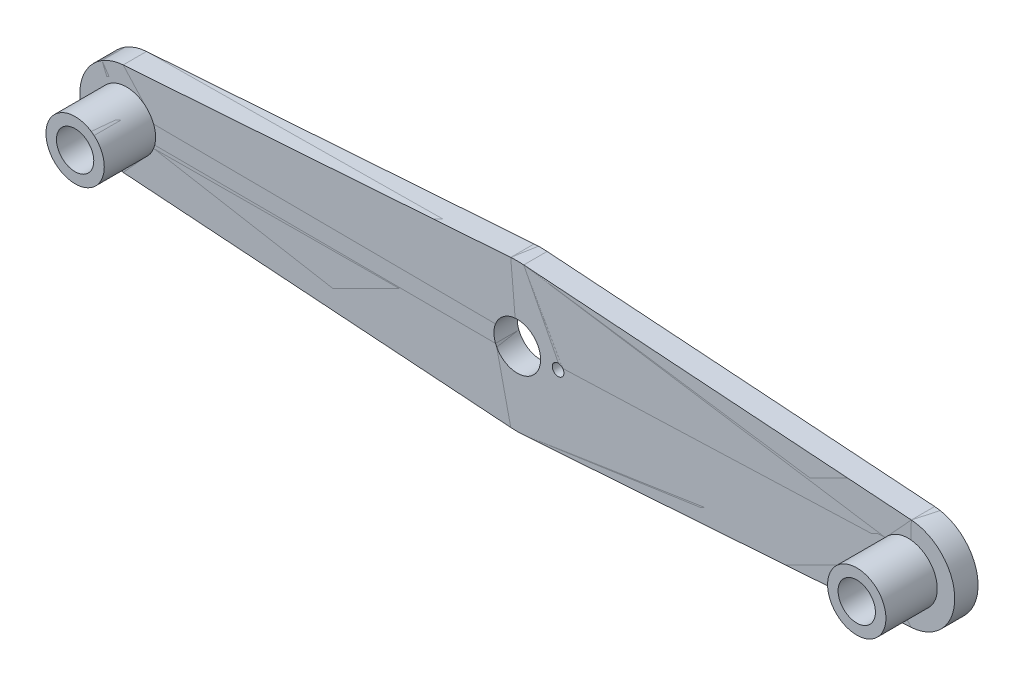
ISO-10303-21;
HEADER;
FILE_DESCRIPTION(('STEP AP214'),'2;1');
FILE_NAME('part.step','',(''),(''),'','','');
FILE_SCHEMA(('AUTOMOTIVE_DESIGN { 1 0 10303 214 1 1 1 1 }'));
ENDSEC;
DATA;
#1=APPLICATION_CONTEXT('core data for automotive mechanical design processes');
#2=APPLICATION_PROTOCOL_DEFINITION('international standard','automotive_design',2000,#1);
#3=PRODUCT_CONTEXT('',#1,'mechanical');
#4=PRODUCT('Part','Part','',(#3));
#5=PRODUCT_RELATED_PRODUCT_CATEGORY('part','',(#4));
#6=PRODUCT_DEFINITION_FORMATION('','',#4);
#7=PRODUCT_DEFINITION_CONTEXT('part definition',#1,'design');
#8=PRODUCT_DEFINITION('design','',#6,#7);
#9=PRODUCT_DEFINITION_SHAPE('','',#8);
#10=(LENGTH_UNIT() NAMED_UNIT(*) SI_UNIT(.MILLI.,.METRE.));
#11=(NAMED_UNIT(*) PLANE_ANGLE_UNIT() SI_UNIT($,.RADIAN.));
#12=(NAMED_UNIT(*) SI_UNIT($,.STERADIAN.) SOLID_ANGLE_UNIT());
#13=UNCERTAINTY_MEASURE_WITH_UNIT(LENGTH_MEASURE(1.E-05),#10,'distance_accuracy_value','');
#14=(GEOMETRIC_REPRESENTATION_CONTEXT(3) GLOBAL_UNCERTAINTY_ASSIGNED_CONTEXT((#13)) GLOBAL_UNIT_ASSIGNED_CONTEXT((#10,
#11,#12)) REPRESENTATION_CONTEXT('',''));
#15=CARTESIAN_POINT('',(0.,0.,0.));
#16=DIRECTION('',(0.,0.,1.));
#17=DIRECTION('',(1.,0.,0.));
#18=AXIS2_PLACEMENT_3D('',#15,#16,#17);
#19=CARTESIAN_POINT('',(-180.,-12.5,22.));
#20=DIRECTION('',(0.,0.,1.));
#21=DIRECTION('',(1.,0.,0.));
#22=AXIS2_PLACEMENT_3D('',#19,#20,#21);
#23=PLANE('',#22);
#24=CARTESIAN_POINT('',(-167.5,0.,22.));
#25=DIRECTION('',(0.,0.,1.));
#26=DIRECTION('',(0.,-1.,0.));
#27=AXIS2_PLACEMENT_3D('',#24,#25,#26);
#28=CIRCLE('',#27,8.00000000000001);
#29=CARTESIAN_POINT('',(-167.5,-8.00000000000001,22.));
#30=VERTEX_POINT('',#29);
#31=EDGE_CURVE('P0_E422',#30,#30,#28,.T.);
#32=ORIENTED_EDGE('',*,*,#31,.F.);
#33=EDGE_LOOP('',(#32));
#34=FACE_BOUND('',#33,.T.);
#35=CARTESIAN_POINT('',(-167.5,0.,22.));
#36=DIRECTION('',(0.,0.,1.));
#37=DIRECTION('',(1.,0.,0.));
#38=AXIS2_PLACEMENT_3D('',#35,#36,#37);
#39=CIRCLE('',#38,12.5);
#40=CARTESIAN_POINT('',(-155.,0.,22.));
#41=VERTEX_POINT('',#40);
#42=EDGE_CURVE('P0_E352',#41,#41,#39,.T.);
#43=ORIENTED_EDGE('',*,*,#42,.T.);
#44=EDGE_LOOP('',(#43));
#45=FACE_BOUND('',#44,.T.);
#46=ADVANCED_FACE('P0_F348',(#34,#45),#23,.T.);
#47=CARTESIAN_POINT('',(155.,-12.5,22.));
#48=DIRECTION('',(0.,0.,1.));
#49=DIRECTION('',(1.,0.,0.));
#50=AXIS2_PLACEMENT_3D('',#47,#48,#49);
#51=PLANE('',#50);
#52=CARTESIAN_POINT('',(167.5,0.,22.));
#53=DIRECTION('',(0.,0.,1.));
#54=DIRECTION('',(0.,-1.,0.));
#55=AXIS2_PLACEMENT_3D('',#52,#53,#54);
#56=CIRCLE('',#55,8.00000000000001);
#57=CARTESIAN_POINT('',(167.5,-8.00000000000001,22.));
#58=VERTEX_POINT('',#57);
#59=EDGE_CURVE('P0_E436',#58,#58,#56,.T.);
#60=ORIENTED_EDGE('',*,*,#59,.F.);
#61=EDGE_LOOP('',(#60));
#62=FACE_BOUND('',#61,.T.);
#63=CARTESIAN_POINT('',(167.5,0.,22.));
#64=DIRECTION('',(0.,0.,1.));
#65=DIRECTION('',(1.,0.,0.));
#66=AXIS2_PLACEMENT_3D('',#63,#64,#65);
#67=CIRCLE('',#66,12.5);
#68=CARTESIAN_POINT('',(180.,0.,22.));
#69=VERTEX_POINT('',#68);
#70=EDGE_CURVE('P0_E443',#69,#69,#67,.T.);
#71=ORIENTED_EDGE('',*,*,#70,.T.);
#72=EDGE_LOOP('',(#71));
#73=FACE_BOUND('',#72,.T.);
#74=ADVANCED_FACE('P0_F457',(#62,#73),#51,.T.);
#75=CARTESIAN_POINT('',(-167.5,0.,0.));
#76=DIRECTION('',(0.,0.,1.));
#77=DIRECTION('',(1.,0.,0.));
#78=AXIS2_PLACEMENT_3D('',#75,#76,#77);
#79=CYLINDRICAL_SURFACE('',#78,12.5);
#80=CARTESIAN_POINT('',(-167.5,0.,0.));
#81=DIRECTION('',(0.,0.,1.));
#82=DIRECTION('',(1.,0.,0.));
#83=AXIS2_PLACEMENT_3D('',#80,#81,#82);
#84=CIRCLE('',#83,12.5);
#85=CARTESIAN_POINT('',(-155.,0.,0.));
#86=VERTEX_POINT('',#85);
#87=EDGE_CURVE('P0_E515',#86,#86,#84,.F.);
#88=ORIENTED_EDGE('',*,*,#87,.F.);
#89=EDGE_LOOP('',(#88));
#90=FACE_BOUND('',#89,.T.);
#91=ORIENTED_EDGE('',*,*,#42,.F.);
#92=EDGE_LOOP('',(#91));
#93=FACE_BOUND('',#92,.T.);
#94=ADVANCED_FACE('P0_F454',(#90,#93),#79,.T.);
#95=CARTESIAN_POINT('',(167.5,0.,0.));
#96=DIRECTION('',(0.,0.,1.));
#97=DIRECTION('',(1.,0.,0.));
#98=AXIS2_PLACEMENT_3D('',#95,#96,#97);
#99=CYLINDRICAL_SURFACE('',#98,12.5);
#100=CARTESIAN_POINT('',(167.5,0.,0.));
#101=DIRECTION('',(0.,0.,1.));
#102=DIRECTION('',(1.,0.,0.));
#103=AXIS2_PLACEMENT_3D('',#100,#101,#102);
#104=CIRCLE('',#103,12.5);
#105=CARTESIAN_POINT('',(180.,0.,0.));
#106=VERTEX_POINT('',#105);
#107=EDGE_CURVE('P0_E512',#106,#106,#104,.F.);
#108=ORIENTED_EDGE('',*,*,#107,.F.);
#109=EDGE_LOOP('',(#108));
#110=FACE_BOUND('',#109,.T.);
#111=ORIENTED_EDGE('',*,*,#70,.F.);
#112=EDGE_LOOP('',(#111));
#113=FACE_BOUND('',#112,.T.);
#114=ADVANCED_FACE('P0_F456',(#110,#113),#99,.T.);
#115=CARTESIAN_POINT('',(-167.5,0.,-10.));
#116=DIRECTION('',(0.,0.,1.));
#117=DIRECTION('',(0.,-1.,0.));
#118=AXIS2_PLACEMENT_3D('',#115,#116,#117);
#119=CYLINDRICAL_SURFACE('',#118,20.);
#120=DIRECTION('',(0.,0.,1.));
#121=VECTOR('',#120,1.);
#122=CARTESIAN_POINT('',(-168.89512947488,19.951281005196,-83.255240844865));
#123=LINE('',#122,#121);
#124=CARTESIAN_POINT('',(-168.895129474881,19.9512810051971,-10.));
#125=VERTEX_POINT('',#124);
#126=CARTESIAN_POINT('',(-168.895129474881,19.9512810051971,0.));
#127=VERTEX_POINT('',#126);
#128=EDGE_CURVE('P0_E445',#125,#127,#123,.T.);
#129=ORIENTED_EDGE('',*,*,#128,.F.);
#130=CARTESIAN_POINT('',(-167.5,0.,-10.));
#131=DIRECTION('',(0.,0.,1.));
#132=DIRECTION('',(0.,-1.,0.));
#133=AXIS2_PLACEMENT_3D('',#130,#131,#132);
#134=CIRCLE('',#133,20.);
#135=CARTESIAN_POINT('',(-168.895129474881,-19.9512810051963,-10.));
#136=VERTEX_POINT('',#135);
#137=EDGE_CURVE('P0_E551',#136,#125,#134,.F.);
#138=ORIENTED_EDGE('',*,*,#137,.F.);
#139=DIRECTION('',(0.,0.,-1.));
#140=VECTOR('',#139,1.);
#141=CARTESIAN_POINT('',(-168.89512947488,-19.951281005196,-83.255240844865));
#142=LINE('',#141,#140);
#143=CARTESIAN_POINT('',(-168.895129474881,-19.9512810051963,0.));
#144=VERTEX_POINT('',#143);
#145=EDGE_CURVE('P0_E412',#144,#136,#142,.T.);
#146=ORIENTED_EDGE('',*,*,#145,.F.);
#147=CARTESIAN_POINT('',(-167.5,0.,0.));
#148=DIRECTION('',(0.,0.,1.));
#149=DIRECTION('',(0.,-1.,0.));
#150=AXIS2_PLACEMENT_3D('',#147,#148,#149);
#151=CIRCLE('',#150,20.);
#152=EDGE_CURVE('P0_E435',#127,#144,#151,.T.);
#153=ORIENTED_EDGE('',*,*,#152,.F.);
#154=EDGE_LOOP('',(#129,#138,#146,#153));
#155=FACE_BOUND('',#154,.T.);
#156=ADVANCED_FACE('P0_F464',(#155),#119,.T.);
#157=CARTESIAN_POINT('',(-2.7902589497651,31.566465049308,0.));
#158=DIRECTION('',(-0.0697564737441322,0.997564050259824,0.));
#159=DIRECTION('',(0.,0.,-1.));
#160=AXIS2_PLACEMENT_3D('',#157,#158,#159);
#161=PLANE('',#160);
#162=DIRECTION('',(0.997564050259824,0.0697564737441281,0.));
#163=VECTOR('',#162,1.);
#164=CARTESIAN_POINT('',(-168.895129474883,19.9512810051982,-10.));
#165=LINE('',#164,#163);
#166=CARTESIAN_POINT('',(-2.79025894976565,31.5664650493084,-10.));
#167=VERTEX_POINT('',#166);
#168=EDGE_CURVE('P0_E548',#125,#167,#165,.T.);
#169=ORIENTED_EDGE('',*,*,#168,.F.);
#170=ORIENTED_EDGE('',*,*,#128,.T.);
#171=DIRECTION('',(-0.997564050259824,-0.0697564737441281,0.));
#172=VECTOR('',#171,1.);
#173=CARTESIAN_POINT('',(-2.79025894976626,31.5664650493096,0.));
#174=LINE('',#173,#172);
#175=CARTESIAN_POINT('',(-2.79025894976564,31.5664650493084,0.));
#176=VERTEX_POINT('',#175);
#177=EDGE_CURVE('P0_E558',#176,#127,#174,.T.);
#178=ORIENTED_EDGE('',*,*,#177,.F.);
#179=DIRECTION('',(0.,0.,-1.));
#180=VECTOR('',#179,1.);
#181=CARTESIAN_POINT('',(-2.79025894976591,31.5664650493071,-5.));
#182=LINE('',#181,#180);
#183=EDGE_CURVE('P0_E448',#176,#167,#182,.T.);
#184=ORIENTED_EDGE('',*,*,#183,.T.);
#185=EDGE_LOOP('',(#169,#170,#178,#184));
#186=FACE_BOUND('',#185,.T.);
#187=ADVANCED_FACE('P0_F486',(#186),#161,.T.);
#188=CARTESIAN_POINT('',(-1.1487285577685E-13,-8.3360969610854,0.));
#189=DIRECTION('',(0.,0.,-1.));
#190=DIRECTION('',(-1.,0.,0.));
#191=AXIS2_PLACEMENT_3D('',#188,#189,#190);
#192=CYLINDRICAL_SURFACE('',#191,39.9999999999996);
#193=CARTESIAN_POINT('',(-1.1487285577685E-13,-8.3360969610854,0.));
#194=DIRECTION('',(0.,0.,-1.));
#195=DIRECTION('',(-1.,0.,0.));
#196=AXIS2_PLACEMENT_3D('',#193,#194,#195);
#197=CIRCLE('',#196,39.9999999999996);
#198=CARTESIAN_POINT('',(2.79025894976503,31.5664650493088,0.));
#199=VERTEX_POINT('',#198);
#200=EDGE_CURVE('P0_E560',#199,#176,#197,.F.);
#201=ORIENTED_EDGE('',*,*,#200,.F.);
#202=DIRECTION('',(0.,0.,1.));
#203=VECTOR('',#202,1.);
#204=CARTESIAN_POINT('',(2.7902589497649,31.566465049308,-83.255240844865));
#205=LINE('',#204,#203);
#206=CARTESIAN_POINT('',(2.79025894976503,31.5664650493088,-10.));
#207=VERTEX_POINT('',#206);
#208=EDGE_CURVE('P0_E577',#207,#199,#205,.T.);
#209=ORIENTED_EDGE('',*,*,#208,.F.);
#210=CARTESIAN_POINT('',(-1.1487285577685E-13,-8.3360969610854,-10.));
#211=DIRECTION('',(0.,0.,-1.));
#212=DIRECTION('',(-1.,0.,0.));
#213=AXIS2_PLACEMENT_3D('',#210,#211,#212);
#214=CIRCLE('',#213,39.9999999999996);
#215=EDGE_CURVE('P0_E545',#167,#207,#214,.T.);
#216=ORIENTED_EDGE('',*,*,#215,.F.);
#217=ORIENTED_EDGE('',*,*,#183,.F.);
#218=EDGE_LOOP('',(#201,#209,#216,#217));
#219=FACE_BOUND('',#218,.T.);
#220=ADVANCED_FACE('P0_F489',(#219),#192,.T.);
#221=CARTESIAN_POINT('',(168.89512947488,19.951281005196,0.));
#222=DIRECTION('',(0.0697564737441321,0.997564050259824,0.));
#223=DIRECTION('',(0.,0.,-1.));
#224=AXIS2_PLACEMENT_3D('',#221,#222,#223);
#225=PLANE('',#224);
#226=DIRECTION('',(0.997564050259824,-0.0697564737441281,0.));
#227=VECTOR('',#226,1.);
#228=CARTESIAN_POINT('',(2.79025894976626,31.5664650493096,-10.));
#229=LINE('',#228,#227);
#230=CARTESIAN_POINT('',(168.895129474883,19.9512810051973,-10.));
#231=VERTEX_POINT('',#230);
#232=EDGE_CURVE('P0_E542',#207,#231,#229,.T.);
#233=ORIENTED_EDGE('',*,*,#232,.F.);
#234=ORIENTED_EDGE('',*,*,#208,.T.);
#235=DIRECTION('',(-0.997564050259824,0.0697564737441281,0.));
#236=VECTOR('',#235,1.);
#237=CARTESIAN_POINT('',(168.895129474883,19.9512810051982,0.));
#238=LINE('',#237,#236);
#239=CARTESIAN_POINT('',(168.895129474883,19.9512810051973,0.));
#240=VERTEX_POINT('',#239);
#241=EDGE_CURVE('P0_E563',#240,#199,#238,.T.);
#242=ORIENTED_EDGE('',*,*,#241,.F.);
#243=DIRECTION('',(0.,0.,-1.));
#244=VECTOR('',#243,1.);
#245=CARTESIAN_POINT('',(168.895129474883,19.9512810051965,-5.));
#246=LINE('',#245,#244);
#247=EDGE_CURVE('P0_E573',#240,#231,#246,.T.);
#248=ORIENTED_EDGE('',*,*,#247,.T.);
#249=EDGE_LOOP('',(#233,#234,#242,#248));
#250=FACE_BOUND('',#249,.T.);
#251=ADVANCED_FACE('P0_F491',(#250),#225,.T.);
#252=CARTESIAN_POINT('',(167.5,0.,-10.));
#253=DIRECTION('',(0.,0.,1.));
#254=DIRECTION('',(0.,-1.,0.));
#255=AXIS2_PLACEMENT_3D('',#252,#253,#254);
#256=CYLINDRICAL_SURFACE('',#255,20.);
#257=DIRECTION('',(0.,0.,1.));
#258=VECTOR('',#257,1.);
#259=CARTESIAN_POINT('',(168.89512947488,-19.951281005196,-83.255240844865));
#260=LINE('',#259,#258);
#261=CARTESIAN_POINT('',(168.895129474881,-19.9512810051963,-10.));
#262=VERTEX_POINT('',#261);
#263=CARTESIAN_POINT('',(168.895129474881,-19.9512810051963,0.));
#264=VERTEX_POINT('',#263);
#265=EDGE_CURVE('P0_E570',#262,#264,#260,.T.);
#266=ORIENTED_EDGE('',*,*,#265,.F.);
#267=CARTESIAN_POINT('',(167.5,0.,-10.));
#268=DIRECTION('',(0.,0.,1.));
#269=DIRECTION('',(0.,-1.,0.));
#270=AXIS2_PLACEMENT_3D('',#267,#268,#269);
#271=CIRCLE('',#270,20.);
#272=EDGE_CURVE('P0_E539',#231,#262,#271,.F.);
#273=ORIENTED_EDGE('',*,*,#272,.F.);
#274=ORIENTED_EDGE('',*,*,#247,.F.);
#275=CARTESIAN_POINT('',(167.5,0.,0.));
#276=DIRECTION('',(0.,0.,1.));
#277=DIRECTION('',(0.,-1.,0.));
#278=AXIS2_PLACEMENT_3D('',#275,#276,#277);
#279=CIRCLE('',#278,20.);
#280=EDGE_CURVE('P0_E566',#264,#240,#279,.T.);
#281=ORIENTED_EDGE('',*,*,#280,.F.);
#282=EDGE_LOOP('',(#266,#273,#274,#281));
#283=FACE_BOUND('',#282,.T.);
#284=ADVANCED_FACE('P0_F494',(#283),#256,.T.);
#285=CARTESIAN_POINT('',(2.790258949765,-31.566465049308,0.));
#286=DIRECTION('',(0.0697564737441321,-0.997564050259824,0.));
#287=DIRECTION('',(0.,0.,-1.));
#288=AXIS2_PLACEMENT_3D('',#285,#286,#287);
#289=PLANE('',#288);
#290=DIRECTION('',(-0.997564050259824,-0.0697564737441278,0.));
#291=VECTOR('',#290,1.);
#292=CARTESIAN_POINT('',(168.895129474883,-19.9512810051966,-10.));
#293=LINE('',#292,#291);
#294=CARTESIAN_POINT('',(2.79025894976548,-31.5664650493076,-10.));
#295=VERTEX_POINT('',#294);
#296=EDGE_CURVE('P0_E536',#262,#295,#293,.T.);
#297=ORIENTED_EDGE('',*,*,#296,.F.);
#298=ORIENTED_EDGE('',*,*,#265,.T.);
#299=DIRECTION('',(0.997564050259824,0.0697564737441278,0.));
#300=VECTOR('',#299,1.);
#301=CARTESIAN_POINT('',(2.79025894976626,-31.566465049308,0.));
#302=LINE('',#301,#300);
#303=CARTESIAN_POINT('',(2.79025894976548,-31.5664650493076,0.));
#304=VERTEX_POINT('',#303);
#305=EDGE_CURVE('P0_E431',#304,#264,#302,.T.);
#306=ORIENTED_EDGE('',*,*,#305,.F.);
#307=DIRECTION('',(0.,0.,-1.));
#308=VECTOR('',#307,1.);
#309=CARTESIAN_POINT('',(2.79025894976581,-31.5664650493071,-5.));
#310=LINE('',#309,#308);
#311=EDGE_CURVE('P0_E427',#304,#295,#310,.T.);
#312=ORIENTED_EDGE('',*,*,#311,.T.);
#313=EDGE_LOOP('',(#297,#298,#306,#312));
#314=FACE_BOUND('',#313,.T.);
#315=ADVANCED_FACE('P0_F496',(#314),#289,.T.);
#316=CARTESIAN_POINT('',(0.,8.3360969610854,0.));
#317=DIRECTION('',(0.,0.,-1.));
#318=DIRECTION('',(-1.,0.,0.));
#319=AXIS2_PLACEMENT_3D('',#316,#317,#318);
#320=CYLINDRICAL_SURFACE('',#319,39.9999999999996);
#321=CARTESIAN_POINT('',(0.,8.3360969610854,0.));
#322=DIRECTION('',(0.,0.,-1.));
#323=DIRECTION('',(-1.,0.,0.));
#324=AXIS2_PLACEMENT_3D('',#321,#322,#323);
#325=CIRCLE('',#324,39.9999999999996);
#326=CARTESIAN_POINT('',(-2.79025894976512,-31.566465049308,0.));
#327=VERTEX_POINT('',#326);
#328=EDGE_CURVE('P0_E425',#327,#304,#325,.F.);
#329=ORIENTED_EDGE('',*,*,#328,.F.);
#330=DIRECTION('',(0.,0.,1.));
#331=VECTOR('',#330,1.);
#332=CARTESIAN_POINT('',(-2.7902589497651,-31.566465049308,-83.255240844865));
#333=LINE('',#332,#331);
#334=CARTESIAN_POINT('',(-2.79025894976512,-31.566465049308,-10.));
#335=VERTEX_POINT('',#334);
#336=EDGE_CURVE('P0_E367',#335,#327,#333,.T.);
#337=ORIENTED_EDGE('',*,*,#336,.F.);
#338=CARTESIAN_POINT('',(0.,8.3360969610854,-10.));
#339=DIRECTION('',(0.,0.,-1.));
#340=DIRECTION('',(-1.,0.,0.));
#341=AXIS2_PLACEMENT_3D('',#338,#339,#340);
#342=CIRCLE('',#341,39.9999999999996);
#343=EDGE_CURVE('P0_E534',#295,#335,#342,.T.);
#344=ORIENTED_EDGE('',*,*,#343,.F.);
#345=ORIENTED_EDGE('',*,*,#311,.F.);
#346=EDGE_LOOP('',(#329,#337,#344,#345));
#347=FACE_BOUND('',#346,.T.);
#348=ADVANCED_FACE('P0_F426',(#347),#320,.T.);
#349=CARTESIAN_POINT('',(-168.89512947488,-19.951281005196,0.));
#350=DIRECTION('',(-0.0697564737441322,-0.997564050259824,0.));
#351=DIRECTION('',(0.,0.,-1.));
#352=AXIS2_PLACEMENT_3D('',#349,#350,#351);
#353=PLANE('',#352);
#354=DIRECTION('',(-0.997564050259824,0.0697564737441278,0.));
#355=VECTOR('',#354,1.);
#356=CARTESIAN_POINT('',(-2.79025894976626,-31.566465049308,-10.));
#357=LINE('',#356,#355);
#358=EDGE_CURVE('P0_E420',#335,#136,#357,.T.);
#359=ORIENTED_EDGE('',*,*,#358,.F.);
#360=ORIENTED_EDGE('',*,*,#336,.T.);
#361=DIRECTION('',(0.997564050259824,-0.0697564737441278,0.));
#362=VECTOR('',#361,1.);
#363=CARTESIAN_POINT('',(-168.895129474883,-19.9512810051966,0.));
#364=LINE('',#363,#362);
#365=EDGE_CURVE('P0_E417',#144,#327,#364,.T.);
#366=ORIENTED_EDGE('',*,*,#365,.F.);
#367=ORIENTED_EDGE('',*,*,#145,.T.);
#368=EDGE_LOOP('',(#359,#360,#366,#367));
#369=FACE_BOUND('',#368,.T.);
#370=ADVANCED_FACE('P0_F415',(#369),#353,.T.);
#371=CARTESIAN_POINT('',(17.5,0.,-10.));
#372=DIRECTION('',(0.,0.,1.));
#373=DIRECTION('',(0.,-1.,0.));
#374=AXIS2_PLACEMENT_3D('',#371,#372,#373);
#375=CYLINDRICAL_SURFACE('',#374,2.5);
#376=CARTESIAN_POINT('',(17.5,0.,-10.));
#377=DIRECTION('',(0.,0.,1.));
#378=DIRECTION('',(0.,-1.,0.));
#379=AXIS2_PLACEMENT_3D('',#376,#377,#378);
#380=CIRCLE('',#379,2.5);
#381=CARTESIAN_POINT('',(17.5,-2.5,-10.));
#382=VERTEX_POINT('',#381);
#383=EDGE_CURVE('P0_E530',#382,#382,#380,.T.);
#384=ORIENTED_EDGE('',*,*,#383,.F.);
#385=EDGE_LOOP('',(#384));
#386=FACE_BOUND('',#385,.T.);
#387=CARTESIAN_POINT('',(17.5,0.,0.));
#388=DIRECTION('',(0.,0.,1.));
#389=DIRECTION('',(0.,-1.,0.));
#390=AXIS2_PLACEMENT_3D('',#387,#388,#389);
#391=CIRCLE('',#390,2.5);
#392=CARTESIAN_POINT('',(17.5,-2.5,0.));
#393=VERTEX_POINT('',#392);
#394=EDGE_CURVE('P0_E519',#393,#393,#391,.F.);
#395=ORIENTED_EDGE('',*,*,#394,.F.);
#396=EDGE_LOOP('',(#395));
#397=FACE_BOUND('',#396,.T.);
#398=ADVANCED_FACE('P0_F501',(#386,#397),#375,.F.);
#399=CARTESIAN_POINT('',(-167.5,0.,-10.));
#400=DIRECTION('',(0.,0.,1.));
#401=DIRECTION('',(0.,-1.,0.));
#402=AXIS2_PLACEMENT_3D('',#399,#400,#401);
#403=CYLINDRICAL_SURFACE('',#402,8.00000000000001);
#404=CARTESIAN_POINT('',(-167.5,0.,-10.));
#405=DIRECTION('',(0.,0.,1.));
#406=DIRECTION('',(0.,-1.,0.));
#407=AXIS2_PLACEMENT_3D('',#404,#405,#406);
#408=CIRCLE('',#407,8.00000000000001);
#409=CARTESIAN_POINT('',(-167.5,-8.00000000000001,-10.));
#410=VERTEX_POINT('',#409);
#411=EDGE_CURVE('P0_E525',#410,#410,#408,.T.);
#412=ORIENTED_EDGE('',*,*,#411,.F.);
#413=EDGE_LOOP('',(#412));
#414=FACE_BOUND('',#413,.T.);
#415=ORIENTED_EDGE('',*,*,#31,.T.);
#416=EDGE_LOOP('',(#415));
#417=FACE_BOUND('',#416,.T.);
#418=ADVANCED_FACE('P0_F507',(#414,#417),#403,.F.);
#419=CARTESIAN_POINT('',(167.5,0.,-10.));
#420=DIRECTION('',(0.,0.,1.));
#421=DIRECTION('',(0.,-1.,0.));
#422=AXIS2_PLACEMENT_3D('',#419,#420,#421);
#423=CYLINDRICAL_SURFACE('',#422,8.00000000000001);
#424=CARTESIAN_POINT('',(167.5,0.,-10.));
#425=DIRECTION('',(0.,0.,1.));
#426=DIRECTION('',(0.,-1.,0.));
#427=AXIS2_PLACEMENT_3D('',#424,#425,#426);
#428=CIRCLE('',#427,8.00000000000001);
#429=CARTESIAN_POINT('',(167.5,-8.00000000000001,-10.));
#430=VERTEX_POINT('',#429);
#431=EDGE_CURVE('P0_E522',#430,#430,#428,.T.);
#432=ORIENTED_EDGE('',*,*,#431,.F.);
#433=EDGE_LOOP('',(#432));
#434=FACE_BOUND('',#433,.T.);
#435=ORIENTED_EDGE('',*,*,#59,.T.);
#436=EDGE_LOOP('',(#435));
#437=FACE_BOUND('',#436,.T.);
#438=ADVANCED_FACE('P0_F481',(#434,#437),#423,.F.);
#439=CARTESIAN_POINT('',(-187.5,-35.413903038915,0.));
#440=DIRECTION('',(0.,0.,1.));
#441=DIRECTION('',(1.,0.,0.));
#442=AXIS2_PLACEMENT_3D('',#439,#440,#441);
#443=PLANE('',#442);
#444=ORIENTED_EDGE('',*,*,#107,.T.);
#445=EDGE_LOOP('',(#444));
#446=FACE_BOUND('',#445,.T.);
#447=ORIENTED_EDGE('',*,*,#87,.T.);
#448=EDGE_LOOP('',(#447));
#449=FACE_BOUND('',#448,.T.);
#450=ORIENTED_EDGE('',*,*,#394,.T.);
#451=EDGE_LOOP('',(#450));
#452=FACE_BOUND('',#451,.T.);
#453=CARTESIAN_POINT('',(0.,0.,0.));
#454=DIRECTION('',(0.,0.,-1.));
#455=DIRECTION('',(-1.,0.,0.));
#456=AXIS2_PLACEMENT_3D('',#453,#454,#455);
#457=CIRCLE('',#456,10.);
#458=CARTESIAN_POINT('',(-10.,0.,0.));
#459=VERTEX_POINT('',#458);
#460=EDGE_CURVE('P0_E358',#459,#459,#457,.F.);
#461=ORIENTED_EDGE('',*,*,#460,.F.);
#462=EDGE_LOOP('',(#461));
#463=FACE_BOUND('',#462,.T.);
#464=ORIENTED_EDGE('',*,*,#177,.T.);
#465=ORIENTED_EDGE('',*,*,#152,.T.);
#466=ORIENTED_EDGE('',*,*,#365,.T.);
#467=ORIENTED_EDGE('',*,*,#328,.T.);
#468=ORIENTED_EDGE('',*,*,#305,.T.);
#469=ORIENTED_EDGE('',*,*,#280,.T.);
#470=ORIENTED_EDGE('',*,*,#241,.T.);
#471=ORIENTED_EDGE('',*,*,#200,.T.);
#472=EDGE_LOOP('',(#464,#465,#466,#467,#468,#469,#470,#471));
#473=FACE_BOUND('',#472,.T.);
#474=ADVANCED_FACE('P0_F434',(#446,#449,#452,#463,#473),#443,.T.);
#475=CARTESIAN_POINT('',(187.5,-35.413903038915,-10.));
#476=DIRECTION('',(0.,0.,-1.));
#477=DIRECTION('',(-1.,0.,0.));
#478=AXIS2_PLACEMENT_3D('',#475,#476,#477);
#479=PLANE('',#478);
#480=ORIENTED_EDGE('',*,*,#431,.T.);
#481=EDGE_LOOP('',(#480));
#482=FACE_BOUND('',#481,.T.);
#483=ORIENTED_EDGE('',*,*,#411,.T.);
#484=EDGE_LOOP('',(#483));
#485=FACE_BOUND('',#484,.T.);
#486=ORIENTED_EDGE('',*,*,#383,.T.);
#487=EDGE_LOOP('',(#486));
#488=FACE_BOUND('',#487,.T.);
#489=CARTESIAN_POINT('',(0.,0.,-10.));
#490=DIRECTION('',(0.,0.,-1.));
#491=DIRECTION('',(-1.,0.,0.));
#492=AXIS2_PLACEMENT_3D('',#489,#490,#491);
#493=CIRCLE('',#492,10.);
#494=CARTESIAN_POINT('',(-10.,0.,-10.));
#495=VERTEX_POINT('',#494);
#496=EDGE_CURVE('P0_E11',#495,#495,#493,.T.);
#497=ORIENTED_EDGE('',*,*,#496,.F.);
#498=EDGE_LOOP('',(#497));
#499=FACE_BOUND('',#498,.T.);
#500=ORIENTED_EDGE('',*,*,#343,.T.);
#501=ORIENTED_EDGE('',*,*,#358,.T.);
#502=ORIENTED_EDGE('',*,*,#137,.T.);
#503=ORIENTED_EDGE('',*,*,#168,.T.);
#504=ORIENTED_EDGE('',*,*,#215,.T.);
#505=ORIENTED_EDGE('',*,*,#232,.T.);
#506=ORIENTED_EDGE('',*,*,#272,.T.);
#507=ORIENTED_EDGE('',*,*,#296,.T.);
#508=EDGE_LOOP('',(#500,#501,#502,#503,#504,#505,#506,#507));
#509=FACE_BOUND('',#508,.T.);
#510=ADVANCED_FACE('P0_F350',(#482,#485,#488,#499,#509),#479,.T.);
#511=CARTESIAN_POINT('',(0.,0.,0.));
#512=DIRECTION('',(0.,0.,-1.));
#513=DIRECTION('',(-1.,0.,0.));
#514=AXIS2_PLACEMENT_3D('',#511,#512,#513);
#515=CYLINDRICAL_SURFACE('',#514,10.);
#516=ORIENTED_EDGE('',*,*,#496,.T.);
#517=EDGE_LOOP('',(#516));
#518=FACE_BOUND('',#517,.T.);
#519=ORIENTED_EDGE('',*,*,#460,.T.);
#520=EDGE_LOOP('',(#519));
#521=FACE_BOUND('',#520,.T.);
#522=ADVANCED_FACE('P0_F470',(#518,#521),#515,.F.);
#523=CLOSED_SHELL('',(#46,#74,#94,#114,#156,#187,#220,#251,#284,#315,#348,#370,#398,#418,#438,
#474,#510,#522));
#524=MANIFOLD_SOLID_BREP('P0_B2',#523);
#525=CARTESIAN_POINT('',(-180.,-12.5,22.));
#526=DIRECTION('',(0.,0.,1.));
#527=DIRECTION('',(1.,0.,0.));
#528=AXIS2_PLACEMENT_3D('',#525,#526,#527);
#529=PLANE('',#528);
#530=CARTESIAN_POINT('',(-167.5,0.,22.));
#531=DIRECTION('',(0.,0.,1.));
#532=DIRECTION('',(0.,-1.,0.));
#533=AXIS2_PLACEMENT_3D('',#530,#531,#532);
#534=CIRCLE('',#533,8.00000000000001);
#535=CARTESIAN_POINT('',(-167.5,-8.00000000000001,22.));
#536=VERTEX_POINT('',#535);
#537=EDGE_CURVE('P1_E89',#536,#536,#534,.T.);
#538=ORIENTED_EDGE('',*,*,#537,.F.);
#539=EDGE_LOOP('',(#538));
#540=FACE_BOUND('',#539,.T.);
#541=CARTESIAN_POINT('',(-167.5,0.,22.));
#542=DIRECTION('',(0.,0.,1.));
#543=DIRECTION('',(1.,0.,0.));
#544=AXIS2_PLACEMENT_3D('',#541,#542,#543);
#545=CIRCLE('',#544,12.5);
#546=CARTESIAN_POINT('',(-155.,0.,22.));
#547=VERTEX_POINT('',#546);
#548=EDGE_CURVE('P1_E19',#547,#547,#545,.T.);
#549=ORIENTED_EDGE('',*,*,#548,.T.);
#550=EDGE_LOOP('',(#549));
#551=FACE_BOUND('',#550,.T.);
#552=ADVANCED_FACE('P1_F15',(#540,#551),#529,.T.);
#553=CARTESIAN_POINT('',(155.,-12.5,22.));
#554=DIRECTION('',(0.,0.,1.));
#555=DIRECTION('',(1.,0.,0.));
#556=AXIS2_PLACEMENT_3D('',#553,#554,#555);
#557=PLANE('',#556);
#558=CARTESIAN_POINT('',(167.5,0.,22.));
#559=DIRECTION('',(0.,0.,1.));
#560=DIRECTION('',(0.,-1.,0.));
#561=AXIS2_PLACEMENT_3D('',#558,#559,#560);
#562=CIRCLE('',#561,8.00000000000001);
#563=CARTESIAN_POINT('',(167.5,-8.00000000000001,22.));
#564=VERTEX_POINT('',#563);
#565=EDGE_CURVE('P1_E103',#564,#564,#562,.T.);
#566=ORIENTED_EDGE('',*,*,#565,.F.);
#567=EDGE_LOOP('',(#566));
#568=FACE_BOUND('',#567,.T.);
#569=CARTESIAN_POINT('',(167.5,0.,22.));
#570=DIRECTION('',(0.,0.,1.));
#571=DIRECTION('',(1.,0.,0.));
#572=AXIS2_PLACEMENT_3D('',#569,#570,#571);
#573=CIRCLE('',#572,12.5);
#574=CARTESIAN_POINT('',(180.,0.,22.));
#575=VERTEX_POINT('',#574);
#576=EDGE_CURVE('P1_E110',#575,#575,#573,.T.);
#577=ORIENTED_EDGE('',*,*,#576,.T.);
#578=EDGE_LOOP('',(#577));
#579=FACE_BOUND('',#578,.T.);
#580=ADVANCED_FACE('P1_F124',(#568,#579),#557,.T.);
#581=CARTESIAN_POINT('',(-167.5,0.,0.));
#582=DIRECTION('',(0.,0.,1.));
#583=DIRECTION('',(1.,0.,0.));
#584=AXIS2_PLACEMENT_3D('',#581,#582,#583);
#585=CYLINDRICAL_SURFACE('',#584,12.5);
#586=CARTESIAN_POINT('',(-167.5,0.,0.));
#587=DIRECTION('',(0.,0.,1.));
#588=DIRECTION('',(1.,0.,0.));
#589=AXIS2_PLACEMENT_3D('',#586,#587,#588);
#590=CIRCLE('',#589,12.5);
#591=CARTESIAN_POINT('',(-155.,0.,0.));
#592=VERTEX_POINT('',#591);
#593=EDGE_CURVE('P1_E180',#592,#592,#590,.F.);
#594=ORIENTED_EDGE('',*,*,#593,.F.);
#595=EDGE_LOOP('',(#594));
#596=FACE_BOUND('',#595,.T.);
#597=ORIENTED_EDGE('',*,*,#548,.F.);
#598=EDGE_LOOP('',(#597));
#599=FACE_BOUND('',#598,.T.);
#600=ADVANCED_FACE('P1_F121',(#596,#599),#585,.T.);
#601=CARTESIAN_POINT('',(167.5,0.,0.));
#602=DIRECTION('',(0.,0.,1.));
#603=DIRECTION('',(1.,0.,0.));
#604=AXIS2_PLACEMENT_3D('',#601,#602,#603);
#605=CYLINDRICAL_SURFACE('',#604,12.5);
#606=CARTESIAN_POINT('',(167.5,0.,0.));
#607=DIRECTION('',(0.,0.,1.));
#608=DIRECTION('',(1.,0.,0.));
#609=AXIS2_PLACEMENT_3D('',#606,#607,#608);
#610=CIRCLE('',#609,12.5);
#611=CARTESIAN_POINT('',(180.,0.,0.));
#612=VERTEX_POINT('',#611);
#613=EDGE_CURVE('P1_E177',#612,#612,#610,.F.);
#614=ORIENTED_EDGE('',*,*,#613,.F.);
#615=EDGE_LOOP('',(#614));
#616=FACE_BOUND('',#615,.T.);
#617=ORIENTED_EDGE('',*,*,#576,.F.);
#618=EDGE_LOOP('',(#617));
#619=FACE_BOUND('',#618,.T.);
#620=ADVANCED_FACE('P1_F123',(#616,#619),#605,.T.);
#621=CARTESIAN_POINT('',(-167.5,0.,-10.));
#622=DIRECTION('',(0.,0.,1.));
#623=DIRECTION('',(0.,-1.,0.));
#624=AXIS2_PLACEMENT_3D('',#621,#622,#623);
#625=CYLINDRICAL_SURFACE('',#624,20.);
#626=DIRECTION('',(0.,0.,1.));
#627=VECTOR('',#626,1.);
#628=CARTESIAN_POINT('',(-168.89512947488,19.951281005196,-83.255240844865));
#629=LINE('',#628,#627);
#630=CARTESIAN_POINT('',(-168.895129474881,19.9512810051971,-10.));
#631=VERTEX_POINT('',#630);
#632=CARTESIAN_POINT('',(-168.895129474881,19.9512810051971,0.));
#633=VERTEX_POINT('',#632);
#634=EDGE_CURVE('P1_E112',#631,#633,#629,.T.);
#635=ORIENTED_EDGE('',*,*,#634,.F.);
#636=CARTESIAN_POINT('',(-167.5,0.,-10.));
#637=DIRECTION('',(0.,0.,1.));
#638=DIRECTION('',(0.,-1.,0.));
#639=AXIS2_PLACEMENT_3D('',#636,#637,#638);
#640=CIRCLE('',#639,20.);
#641=CARTESIAN_POINT('',(-168.895129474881,-19.9512810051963,-10.));
#642=VERTEX_POINT('',#641);
#643=EDGE_CURVE('P1_E216',#642,#631,#640,.F.);
#644=ORIENTED_EDGE('',*,*,#643,.F.);
#645=DIRECTION('',(0.,0.,-1.));
#646=VECTOR('',#645,1.);
#647=CARTESIAN_POINT('',(-168.89512947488,-19.951281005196,-83.255240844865));
#648=LINE('',#647,#646);
#649=CARTESIAN_POINT('',(-168.895129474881,-19.9512810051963,0.));
#650=VERTEX_POINT('',#649);
#651=EDGE_CURVE('P1_E79',#650,#642,#648,.T.);
#652=ORIENTED_EDGE('',*,*,#651,.F.);
#653=CARTESIAN_POINT('',(-167.5,0.,0.));
#654=DIRECTION('',(0.,0.,1.));
#655=DIRECTION('',(0.,-1.,0.));
#656=AXIS2_PLACEMENT_3D('',#653,#654,#655);
#657=CIRCLE('',#656,20.);
#658=EDGE_CURVE('P1_E102',#633,#650,#657,.T.);
#659=ORIENTED_EDGE('',*,*,#658,.F.);
#660=EDGE_LOOP('',(#635,#644,#652,#659));
#661=FACE_BOUND('',#660,.T.);
#662=ADVANCED_FACE('P1_F130',(#661),#625,.T.);
#663=CARTESIAN_POINT('',(-2.7902589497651,31.566465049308,0.));
#664=DIRECTION('',(-0.0697564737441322,0.997564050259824,0.));
#665=DIRECTION('',(0.,0.,-1.));
#666=AXIS2_PLACEMENT_3D('',#663,#664,#665);
#667=PLANE('',#666);
#668=DIRECTION('',(0.997564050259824,0.0697564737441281,0.));
#669=VECTOR('',#668,1.);
#670=CARTESIAN_POINT('',(-168.895129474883,19.9512810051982,-10.));
#671=LINE('',#670,#669);
#672=CARTESIAN_POINT('',(-2.79025894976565,31.5664650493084,-10.));
#673=VERTEX_POINT('',#672);
#674=EDGE_CURVE('P1_E213',#631,#673,#671,.T.);
#675=ORIENTED_EDGE('',*,*,#674,.F.);
#676=ORIENTED_EDGE('',*,*,#634,.T.);
#677=DIRECTION('',(-0.997564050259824,-0.0697564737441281,0.));
#678=VECTOR('',#677,1.);
#679=CARTESIAN_POINT('',(-2.79025894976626,31.5664650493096,0.));
#680=LINE('',#679,#678);
#681=CARTESIAN_POINT('',(-2.79025894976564,31.5664650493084,0.));
#682=VERTEX_POINT('',#681);
#683=EDGE_CURVE('P1_E223',#682,#633,#680,.T.);
#684=ORIENTED_EDGE('',*,*,#683,.F.);
#685=DIRECTION('',(0.,0.,-1.));
#686=VECTOR('',#685,1.);
#687=CARTESIAN_POINT('',(-2.79025894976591,31.5664650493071,-5.));
#688=LINE('',#687,#686);
#689=EDGE_CURVE('P1_E115',#682,#673,#688,.T.);
#690=ORIENTED_EDGE('',*,*,#689,.T.);
#691=EDGE_LOOP('',(#675,#676,#684,#690));
#692=FACE_BOUND('',#691,.T.);
#693=ADVANCED_FACE('P1_F152',(#692),#667,.T.);
#694=CARTESIAN_POINT('',(-1.1487285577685E-13,-8.3360969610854,0.));
#695=DIRECTION('',(0.,0.,-1.));
#696=DIRECTION('',(-1.,0.,0.));
#697=AXIS2_PLACEMENT_3D('',#694,#695,#696);
#698=CYLINDRICAL_SURFACE('',#697,39.9999999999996);
#699=CARTESIAN_POINT('',(-1.1487285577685E-13,-8.3360969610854,0.));
#700=DIRECTION('',(0.,0.,-1.));
#701=DIRECTION('',(-1.,0.,0.));
#702=AXIS2_PLACEMENT_3D('',#699,#700,#701);
#703=CIRCLE('',#702,39.9999999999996);
#704=CARTESIAN_POINT('',(2.79025894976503,31.5664650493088,0.));
#705=VERTEX_POINT('',#704);
#706=EDGE_CURVE('P1_E225',#705,#682,#703,.F.);
#707=ORIENTED_EDGE('',*,*,#706,.F.);
#708=DIRECTION('',(0.,0.,1.));
#709=VECTOR('',#708,1.);
#710=CARTESIAN_POINT('',(2.7902589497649,31.566465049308,-83.255240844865));
#711=LINE('',#710,#709);
#712=CARTESIAN_POINT('',(2.79025894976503,31.5664650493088,-10.));
#713=VERTEX_POINT('',#712);
#714=EDGE_CURVE('P1_E242',#713,#705,#711,.T.);
#715=ORIENTED_EDGE('',*,*,#714,.F.);
#716=CARTESIAN_POINT('',(-1.1487285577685E-13,-8.3360969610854,-10.));
#717=DIRECTION('',(0.,0.,-1.));
#718=DIRECTION('',(-1.,0.,0.));
#719=AXIS2_PLACEMENT_3D('',#716,#717,#718);
#720=CIRCLE('',#719,39.9999999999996);
#721=EDGE_CURVE('P1_E210',#673,#713,#720,.T.);
#722=ORIENTED_EDGE('',*,*,#721,.F.);
#723=ORIENTED_EDGE('',*,*,#689,.F.);
#724=EDGE_LOOP('',(#707,#715,#722,#723));
#725=FACE_BOUND('',#724,.T.);
#726=ADVANCED_FACE('P1_F155',(#725),#698,.T.);
#727=CARTESIAN_POINT('',(168.89512947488,19.951281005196,0.));
#728=DIRECTION('',(0.0697564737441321,0.997564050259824,0.));
#729=DIRECTION('',(0.,0.,-1.));
#730=AXIS2_PLACEMENT_3D('',#727,#728,#729);
#731=PLANE('',#730);
#732=DIRECTION('',(0.997564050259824,-0.0697564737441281,0.));
#733=VECTOR('',#732,1.);
#734=CARTESIAN_POINT('',(2.79025894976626,31.5664650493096,-10.));
#735=LINE('',#734,#733);
#736=CARTESIAN_POINT('',(168.895129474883,19.9512810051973,-10.));
#737=VERTEX_POINT('',#736);
#738=EDGE_CURVE('P1_E207',#713,#737,#735,.T.);
#739=ORIENTED_EDGE('',*,*,#738,.F.);
#740=ORIENTED_EDGE('',*,*,#714,.T.);
#741=DIRECTION('',(-0.997564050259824,0.0697564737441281,0.));
#742=VECTOR('',#741,1.);
#743=CARTESIAN_POINT('',(168.895129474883,19.9512810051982,0.));
#744=LINE('',#743,#742);
#745=CARTESIAN_POINT('',(168.895129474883,19.9512810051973,0.));
#746=VERTEX_POINT('',#745);
#747=EDGE_CURVE('P1_E228',#746,#705,#744,.T.);
#748=ORIENTED_EDGE('',*,*,#747,.F.);
#749=DIRECTION('',(0.,0.,-1.));
#750=VECTOR('',#749,1.);
#751=CARTESIAN_POINT('',(168.895129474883,19.9512810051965,-5.));
#752=LINE('',#751,#750);
#753=EDGE_CURVE('P1_E238',#746,#737,#752,.T.);
#754=ORIENTED_EDGE('',*,*,#753,.T.);
#755=EDGE_LOOP('',(#739,#740,#748,#754));
#756=FACE_BOUND('',#755,.T.);
#757=ADVANCED_FACE('P1_F157',(#756),#731,.T.);
#758=CARTESIAN_POINT('',(167.5,0.,-10.));
#759=DIRECTION('',(0.,0.,1.));
#760=DIRECTION('',(0.,-1.,0.));
#761=AXIS2_PLACEMENT_3D('',#758,#759,#760);
#762=CYLINDRICAL_SURFACE('',#761,20.);
#763=DIRECTION('',(0.,0.,1.));
#764=VECTOR('',#763,1.);
#765=CARTESIAN_POINT('',(168.89512947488,-19.951281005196,-83.255240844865));
#766=LINE('',#765,#764);
#767=CARTESIAN_POINT('',(168.895129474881,-19.9512810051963,-10.));
#768=VERTEX_POINT('',#767);
#769=CARTESIAN_POINT('',(168.895129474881,-19.9512810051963,0.));
#770=VERTEX_POINT('',#769);
#771=EDGE_CURVE('P1_E235',#768,#770,#766,.T.);
#772=ORIENTED_EDGE('',*,*,#771,.F.);
#773=CARTESIAN_POINT('',(167.5,0.,-10.));
#774=DIRECTION('',(0.,0.,1.));
#775=DIRECTION('',(0.,-1.,0.));
#776=AXIS2_PLACEMENT_3D('',#773,#774,#775);
#777=CIRCLE('',#776,20.);
#778=EDGE_CURVE('P1_E204',#737,#768,#777,.F.);
#779=ORIENTED_EDGE('',*,*,#778,.F.);
#780=ORIENTED_EDGE('',*,*,#753,.F.);
#781=CARTESIAN_POINT('',(167.5,0.,0.));
#782=DIRECTION('',(0.,0.,1.));
#783=DIRECTION('',(0.,-1.,0.));
#784=AXIS2_PLACEMENT_3D('',#781,#782,#783);
#785=CIRCLE('',#784,20.);
#786=EDGE_CURVE('P1_E231',#770,#746,#785,.T.);
#787=ORIENTED_EDGE('',*,*,#786,.F.);
#788=EDGE_LOOP('',(#772,#779,#780,#787));
#789=FACE_BOUND('',#788,.T.);
#790=ADVANCED_FACE('P1_F160',(#789),#762,.T.);
#791=CARTESIAN_POINT('',(2.790258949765,-31.566465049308,0.));
#792=DIRECTION('',(0.0697564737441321,-0.997564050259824,0.));
#793=DIRECTION('',(0.,0.,-1.));
#794=AXIS2_PLACEMENT_3D('',#791,#792,#793);
#795=PLANE('',#794);
#796=DIRECTION('',(-0.997564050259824,-0.0697564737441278,0.));
#797=VECTOR('',#796,1.);
#798=CARTESIAN_POINT('',(168.895129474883,-19.9512810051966,-10.));
#799=LINE('',#798,#797);
#800=CARTESIAN_POINT('',(2.79025894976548,-31.5664650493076,-10.));
#801=VERTEX_POINT('',#800);
#802=EDGE_CURVE('P1_E201',#768,#801,#799,.T.);
#803=ORIENTED_EDGE('',*,*,#802,.F.);
#804=ORIENTED_EDGE('',*,*,#771,.T.);
#805=DIRECTION('',(0.997564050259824,0.0697564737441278,0.));
#806=VECTOR('',#805,1.);
#807=CARTESIAN_POINT('',(2.79025894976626,-31.566465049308,0.));
#808=LINE('',#807,#806);
#809=CARTESIAN_POINT('',(2.79025894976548,-31.5664650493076,0.));
#810=VERTEX_POINT('',#809);
#811=EDGE_CURVE('P1_E98',#810,#770,#808,.T.);
#812=ORIENTED_EDGE('',*,*,#811,.F.);
#813=DIRECTION('',(0.,0.,-1.));
#814=VECTOR('',#813,1.);
#815=CARTESIAN_POINT('',(2.79025894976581,-31.5664650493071,-5.));
#816=LINE('',#815,#814);
#817=EDGE_CURVE('P1_E94',#810,#801,#816,.T.);
#818=ORIENTED_EDGE('',*,*,#817,.T.);
#819=EDGE_LOOP('',(#803,#804,#812,#818));
#820=FACE_BOUND('',#819,.T.);
#821=ADVANCED_FACE('P1_F162',(#820),#795,.T.);
#822=CARTESIAN_POINT('',(0.,8.3360969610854,0.));
#823=DIRECTION('',(0.,0.,-1.));
#824=DIRECTION('',(-1.,0.,0.));
#825=AXIS2_PLACEMENT_3D('',#822,#823,#824);
#826=CYLINDRICAL_SURFACE('',#825,39.9999999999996);
#827=CARTESIAN_POINT('',(0.,8.3360969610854,0.));
#828=DIRECTION('',(0.,0.,-1.));
#829=DIRECTION('',(-1.,0.,0.));
#830=AXIS2_PLACEMENT_3D('',#827,#828,#829);
#831=CIRCLE('',#830,39.9999999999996);
#832=CARTESIAN_POINT('',(-2.79025894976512,-31.566465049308,0.));
#833=VERTEX_POINT('',#832);
#834=EDGE_CURVE('P1_E92',#833,#810,#831,.F.);
#835=ORIENTED_EDGE('',*,*,#834,.F.);
#836=DIRECTION('',(0.,0.,1.));
#837=VECTOR('',#836,1.);
#838=CARTESIAN_POINT('',(-2.7902589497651,-31.566465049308,-83.255240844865));
#839=LINE('',#838,#837);
#840=CARTESIAN_POINT('',(-2.79025894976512,-31.566465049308,-10.));
#841=VERTEX_POINT('',#840);
#842=EDGE_CURVE('P1_E34',#841,#833,#839,.T.);
#843=ORIENTED_EDGE('',*,*,#842,.F.);
#844=CARTESIAN_POINT('',(0.,8.3360969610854,-10.));
#845=DIRECTION('',(0.,0.,-1.));
#846=DIRECTION('',(-1.,0.,0.));
#847=AXIS2_PLACEMENT_3D('',#844,#845,#846);
#848=CIRCLE('',#847,39.9999999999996);
#849=EDGE_CURVE('P1_E199',#801,#841,#848,.T.);
#850=ORIENTED_EDGE('',*,*,#849,.F.);
#851=ORIENTED_EDGE('',*,*,#817,.F.);
#852=EDGE_LOOP('',(#835,#843,#850,#851));
#853=FACE_BOUND('',#852,.T.);
#854=ADVANCED_FACE('P1_F93',(#853),#826,.T.);
#855=CARTESIAN_POINT('',(-168.89512947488,-19.951281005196,0.));
#856=DIRECTION('',(-0.0697564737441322,-0.997564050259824,0.));
#857=DIRECTION('',(0.,0.,-1.));
#858=AXIS2_PLACEMENT_3D('',#855,#856,#857);
#859=PLANE('',#858);
#860=DIRECTION('',(-0.997564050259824,0.0697564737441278,0.));
#861=VECTOR('',#860,1.);
#862=CARTESIAN_POINT('',(-2.79025894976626,-31.566465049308,-10.));
#863=LINE('',#862,#861);
#864=EDGE_CURVE('P1_E87',#841,#642,#863,.T.);
#865=ORIENTED_EDGE('',*,*,#864,.F.);
#866=ORIENTED_EDGE('',*,*,#842,.T.);
#867=DIRECTION('',(0.997564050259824,-0.0697564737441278,0.));
#868=VECTOR('',#867,1.);
#869=CARTESIAN_POINT('',(-168.895129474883,-19.9512810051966,0.));
#870=LINE('',#869,#868);
#871=EDGE_CURVE('P1_E84',#650,#833,#870,.T.);
#872=ORIENTED_EDGE('',*,*,#871,.F.);
#873=ORIENTED_EDGE('',*,*,#651,.T.);
#874=EDGE_LOOP('',(#865,#866,#872,#873));
#875=FACE_BOUND('',#874,.T.);
#876=ADVANCED_FACE('P1_F82',(#875),#859,.T.);
#877=CARTESIAN_POINT('',(17.5,0.,-10.));
#878=DIRECTION('',(0.,0.,1.));
#879=DIRECTION('',(0.,-1.,0.));
#880=AXIS2_PLACEMENT_3D('',#877,#878,#879);
#881=CYLINDRICAL_SURFACE('',#880,2.5);
#882=CARTESIAN_POINT('',(17.5,0.,-10.));
#883=DIRECTION('',(0.,0.,1.));
#884=DIRECTION('',(0.,-1.,0.));
#885=AXIS2_PLACEMENT_3D('',#882,#883,#884);
#886=CIRCLE('',#885,2.5);
#887=CARTESIAN_POINT('',(17.5,-2.5,-10.));
#888=VERTEX_POINT('',#887);
#889=EDGE_CURVE('P1_E195',#888,#888,#886,.T.);
#890=ORIENTED_EDGE('',*,*,#889,.F.);
#891=EDGE_LOOP('',(#890));
#892=FACE_BOUND('',#891,.T.);
#893=CARTESIAN_POINT('',(17.5,0.,0.));
#894=DIRECTION('',(0.,0.,1.));
#895=DIRECTION('',(0.,-1.,0.));
#896=AXIS2_PLACEMENT_3D('',#893,#894,#895);
#897=CIRCLE('',#896,2.5);
#898=CARTESIAN_POINT('',(17.5,-2.5,0.));
#899=VERTEX_POINT('',#898);
#900=EDGE_CURVE('P1_E184',#899,#899,#897,.F.);
#901=ORIENTED_EDGE('',*,*,#900,.F.);
#902=EDGE_LOOP('',(#901));
#903=FACE_BOUND('',#902,.T.);
#904=ADVANCED_FACE('P1_F167',(#892,#903),#881,.F.);
#905=CARTESIAN_POINT('',(-167.5,0.,-10.));
#906=DIRECTION('',(0.,0.,1.));
#907=DIRECTION('',(0.,-1.,0.));
#908=AXIS2_PLACEMENT_3D('',#905,#906,#907);
#909=CYLINDRICAL_SURFACE('',#908,8.00000000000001);
#910=CARTESIAN_POINT('',(-167.5,0.,-10.));
#911=DIRECTION('',(0.,0.,1.));
#912=DIRECTION('',(0.,-1.,0.));
#913=AXIS2_PLACEMENT_3D('',#910,#911,#912);
#914=CIRCLE('',#913,8.00000000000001);
#915=CARTESIAN_POINT('',(-167.5,-8.00000000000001,-10.));
#916=VERTEX_POINT('',#915);
#917=EDGE_CURVE('P1_E190',#916,#916,#914,.T.);
#918=ORIENTED_EDGE('',*,*,#917,.F.);
#919=EDGE_LOOP('',(#918));
#920=FACE_BOUND('',#919,.T.);
#921=ORIENTED_EDGE('',*,*,#537,.T.);
#922=EDGE_LOOP('',(#921));
#923=FACE_BOUND('',#922,.T.);
#924=ADVANCED_FACE('P1_F172',(#920,#923),#909,.F.);
#925=CARTESIAN_POINT('',(167.5,0.,-10.));
#926=DIRECTION('',(0.,0.,1.));
#927=DIRECTION('',(0.,-1.,0.));
#928=AXIS2_PLACEMENT_3D('',#925,#926,#927);
#929=CYLINDRICAL_SURFACE('',#928,8.00000000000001);
#930=CARTESIAN_POINT('',(167.5,0.,-10.));
#931=DIRECTION('',(0.,0.,1.));
#932=DIRECTION('',(0.,-1.,0.));
#933=AXIS2_PLACEMENT_3D('',#930,#931,#932);
#934=CIRCLE('',#933,8.00000000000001);
#935=CARTESIAN_POINT('',(167.5,-8.00000000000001,-10.));
#936=VERTEX_POINT('',#935);
#937=EDGE_CURVE('P1_E187',#936,#936,#934,.T.);
#938=ORIENTED_EDGE('',*,*,#937,.F.);
#939=EDGE_LOOP('',(#938));
#940=FACE_BOUND('',#939,.T.);
#941=ORIENTED_EDGE('',*,*,#565,.T.);
#942=EDGE_LOOP('',(#941));
#943=FACE_BOUND('',#942,.T.);
#944=ADVANCED_FACE('P1_F147',(#940,#943),#929,.F.);
#945=CARTESIAN_POINT('',(-187.5,-35.413903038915,0.));
#946=DIRECTION('',(0.,0.,1.));
#947=DIRECTION('',(1.,0.,0.));
#948=AXIS2_PLACEMENT_3D('',#945,#946,#947);
#949=PLANE('',#948);
#950=ORIENTED_EDGE('',*,*,#613,.T.);
#951=EDGE_LOOP('',(#950));
#952=FACE_BOUND('',#951,.T.);
#953=ORIENTED_EDGE('',*,*,#593,.T.);
#954=EDGE_LOOP('',(#953));
#955=FACE_BOUND('',#954,.T.);
#956=ORIENTED_EDGE('',*,*,#900,.T.);
#957=EDGE_LOOP('',(#956));
#958=FACE_BOUND('',#957,.T.);
#959=CARTESIAN_POINT('',(0.,0.,0.));
#960=DIRECTION('',(0.,0.,-1.));
#961=DIRECTION('',(-1.,0.,0.));
#962=AXIS2_PLACEMENT_3D('',#959,#960,#961);
#963=CIRCLE('',#962,10.);
#964=CARTESIAN_POINT('',(-10.,0.,0.));
#965=VERTEX_POINT('',#964);
#966=EDGE_CURVE('P1_E25',#965,#965,#963,.F.);
#967=ORIENTED_EDGE('',*,*,#966,.F.);
#968=EDGE_LOOP('',(#967));
#969=FACE_BOUND('',#968,.T.);
#970=ORIENTED_EDGE('',*,*,#683,.T.);
#971=ORIENTED_EDGE('',*,*,#658,.T.);
#972=ORIENTED_EDGE('',*,*,#871,.T.);
#973=ORIENTED_EDGE('',*,*,#834,.T.);
#974=ORIENTED_EDGE('',*,*,#811,.T.);
#975=ORIENTED_EDGE('',*,*,#786,.T.);
#976=ORIENTED_EDGE('',*,*,#747,.T.);
#977=ORIENTED_EDGE('',*,*,#706,.T.);
#978=EDGE_LOOP('',(#970,#971,#972,#973,#974,#975,#976,#977));
#979=FACE_BOUND('',#978,.T.);
#980=ADVANCED_FACE('P1_F101',(#952,#955,#958,#969,#979),#949,.T.);
#981=CARTESIAN_POINT('',(187.5,-35.413903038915,-10.));
#982=DIRECTION('',(0.,0.,-1.));
#983=DIRECTION('',(-1.,0.,0.));
#984=AXIS2_PLACEMENT_3D('',#981,#982,#983);
#985=PLANE('',#984);
#986=ORIENTED_EDGE('',*,*,#937,.T.);
#987=EDGE_LOOP('',(#986));
#988=FACE_BOUND('',#987,.T.);
#989=ORIENTED_EDGE('',*,*,#917,.T.);
#990=EDGE_LOOP('',(#989));
#991=FACE_BOUND('',#990,.T.);
#992=ORIENTED_EDGE('',*,*,#889,.T.);
#993=EDGE_LOOP('',(#992));
#994=FACE_BOUND('',#993,.T.);
#995=CARTESIAN_POINT('',(0.,0.,-10.));
#996=DIRECTION('',(0.,0.,-1.));
#997=DIRECTION('',(-1.,0.,0.));
#998=AXIS2_PLACEMENT_3D('',#995,#996,#997);
#999=CIRCLE('',#998,10.);
#1000=CARTESIAN_POINT('',(-10.,0.,-10.));
#1001=VERTEX_POINT('',#1000);
#1002=EDGE_CURVE('P1_E10',#1001,#1001,#999,.T.);
#1003=ORIENTED_EDGE('',*,*,#1002,.F.);
#1004=EDGE_LOOP('',(#1003));
#1005=FACE_BOUND('',#1004,.T.);
#1006=ORIENTED_EDGE('',*,*,#849,.T.);
#1007=ORIENTED_EDGE('',*,*,#864,.T.);
#1008=ORIENTED_EDGE('',*,*,#643,.T.);
#1009=ORIENTED_EDGE('',*,*,#674,.T.);
#1010=ORIENTED_EDGE('',*,*,#721,.T.);
#1011=ORIENTED_EDGE('',*,*,#738,.T.);
#1012=ORIENTED_EDGE('',*,*,#778,.T.);
#1013=ORIENTED_EDGE('',*,*,#802,.T.);
#1014=EDGE_LOOP('',(#1006,#1007,#1008,#1009,#1010,#1011,#1012,#1013));
#1015=FACE_BOUND('',#1014,.T.);
#1016=ADVANCED_FACE('P1_F17',(#988,#991,#994,#1005,#1015),#985,.T.);
#1017=CARTESIAN_POINT('',(0.,0.,0.));
#1018=DIRECTION('',(0.,0.,-1.));
#1019=DIRECTION('',(-1.,0.,0.));
#1020=AXIS2_PLACEMENT_3D('',#1017,#1018,#1019);
#1021=CYLINDRICAL_SURFACE('',#1020,10.);
#1022=ORIENTED_EDGE('',*,*,#1002,.T.);
#1023=EDGE_LOOP('',(#1022));
#1024=FACE_BOUND('',#1023,.T.);
#1025=ORIENTED_EDGE('',*,*,#966,.T.);
#1026=EDGE_LOOP('',(#1025));
#1027=FACE_BOUND('',#1026,.T.);
#1028=ADVANCED_FACE('P1_F137',(#1024,#1027),#1021,.F.);
#1029=CLOSED_SHELL('',(#552,#580,#600,#620,#662,#693,#726,#757,#790,#821,#854,#876,#904,#924,
#944,#980,#1016,#1028));
#1030=MANIFOLD_SOLID_BREP('P1_B1',#1029);
#1031=ADVANCED_BREP_SHAPE_REPRESENTATION('',(#18,#524,#1030),#14);
#1032=SHAPE_DEFINITION_REPRESENTATION(#9,#1031);
ENDSEC;
END-ISO-10303-21;
